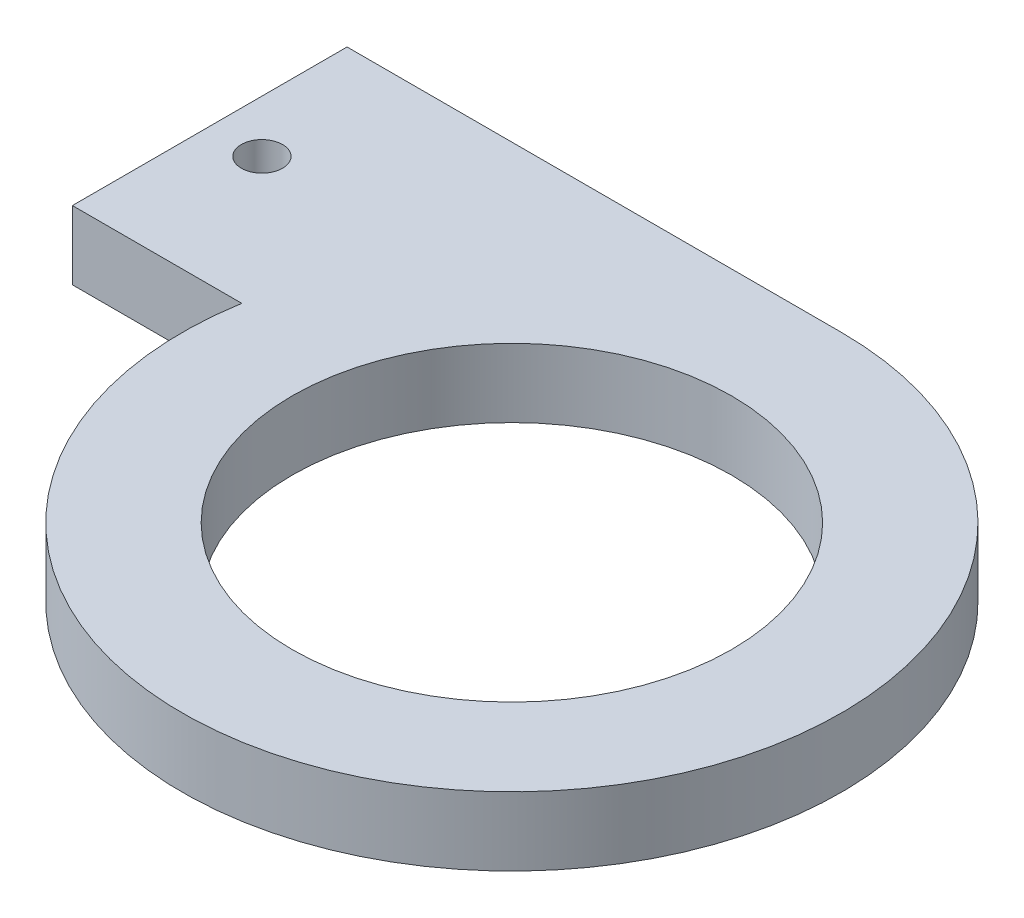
ISO-10303-21;
HEADER;
FILE_DESCRIPTION(('STEP AP214'),'2;1');
FILE_NAME('part.step','',(''),(''),'','','');
FILE_SCHEMA(('AUTOMOTIVE_DESIGN { 1 0 10303 214 1 1 1 1 }'));
ENDSEC;
DATA;
#1=APPLICATION_CONTEXT('core data for automotive mechanical design processes');
#2=APPLICATION_PROTOCOL_DEFINITION('international standard','automotive_design',2000,#1);
#3=PRODUCT_CONTEXT('',#1,'mechanical');
#4=PRODUCT('Part','Part','',(#3));
#5=PRODUCT_RELATED_PRODUCT_CATEGORY('part','',(#4));
#6=PRODUCT_DEFINITION_FORMATION('','',#4);
#7=PRODUCT_DEFINITION_CONTEXT('part definition',#1,'design');
#8=PRODUCT_DEFINITION('design','',#6,#7);
#9=PRODUCT_DEFINITION_SHAPE('','',#8);
#10=(LENGTH_UNIT() NAMED_UNIT(*) SI_UNIT(.MILLI.,.METRE.));
#11=(NAMED_UNIT(*) PLANE_ANGLE_UNIT() SI_UNIT($,.RADIAN.));
#12=(NAMED_UNIT(*) SI_UNIT($,.STERADIAN.) SOLID_ANGLE_UNIT());
#13=UNCERTAINTY_MEASURE_WITH_UNIT(LENGTH_MEASURE(1.E-05),#10,'distance_accuracy_value','');
#14=(GEOMETRIC_REPRESENTATION_CONTEXT(3) GLOBAL_UNCERTAINTY_ASSIGNED_CONTEXT((#13)) GLOBAL_UNIT_ASSIGNED_CONTEXT((#10,
#11,#12)) REPRESENTATION_CONTEXT('',''));
#15=CARTESIAN_POINT('',(0.,0.,0.));
#16=DIRECTION('',(0.,0.,1.));
#17=DIRECTION('',(1.,0.,0.));
#18=AXIS2_PLACEMENT_3D('',#15,#16,#17);
#19=CARTESIAN_POINT('',(0.,5.,-4.));
#20=DIRECTION('',(0.,0.,-1.));
#21=DIRECTION('',(-1.,0.,0.));
#22=AXIS2_PLACEMENT_3D('',#19,#20,#21);
#23=PLANE('',#22);
#24=DIRECTION('',(1.,0.,0.));
#25=VECTOR('',#24,1.);
#26=CARTESIAN_POINT('',(0.,0.,-4.));
#27=LINE('',#26,#25);
#28=CARTESIAN_POINT('',(-36.,0.,-4.));
#29=VERTEX_POINT('',#28);
#30=CARTESIAN_POINT('',(-23.6643191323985,0.,-4.));
#31=VERTEX_POINT('',#30);
#32=EDGE_CURVE('E106',#29,#31,#27,.T.);
#33=ORIENTED_EDGE('',*,*,#32,.T.);
#34=DIRECTION('',(0.,-1.,0.));
#35=VECTOR('',#34,1.);
#36=CARTESIAN_POINT('',(-23.6643191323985,5.,-4.));
#37=LINE('',#36,#35);
#38=CARTESIAN_POINT('',(-23.6643191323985,5.,-4.));
#39=VERTEX_POINT('',#38);
#40=EDGE_CURVE('E11',#39,#31,#37,.T.);
#41=ORIENTED_EDGE('',*,*,#40,.F.);
#42=DIRECTION('',(1.,0.,0.));
#43=VECTOR('',#42,1.);
#44=CARTESIAN_POINT('',(0.,5.,-4.));
#45=LINE('',#44,#43);
#46=CARTESIAN_POINT('',(-36.,5.,-4.));
#47=VERTEX_POINT('',#46);
#48=EDGE_CURVE('E88',#47,#39,#45,.T.);
#49=ORIENTED_EDGE('',*,*,#48,.F.);
#50=DIRECTION('',(0.,-1.,0.));
#51=VECTOR('',#50,1.);
#52=CARTESIAN_POINT('',(-36.,5.,-4.));
#53=LINE('',#52,#51);
#54=EDGE_CURVE('E102',#47,#29,#53,.T.);
#55=ORIENTED_EDGE('',*,*,#54,.T.);
#56=EDGE_LOOP('',(#33,#41,#49,#55));
#57=FACE_BOUND('',#56,.T.);
#58=ADVANCED_FACE('F35',(#57),#23,.F.);
#59=CARTESIAN_POINT('',(0.,5.,0.));
#60=DIRECTION('',(0.,-1.,0.));
#61=DIRECTION('',(0.,0.,-1.));
#62=AXIS2_PLACEMENT_3D('',#59,#60,#61);
#63=CYLINDRICAL_SURFACE('',#62,24.);
#64=CARTESIAN_POINT('',(0.,0.,0.));
#65=DIRECTION('',(0.,1.,0.));
#66=DIRECTION('',(0.,0.,1.));
#67=AXIS2_PLACEMENT_3D('',#64,#65,#66);
#68=CIRCLE('',#67,24.);
#69=CARTESIAN_POINT('',(0.,0.,-24.));
#70=VERTEX_POINT('',#69);
#71=EDGE_CURVE('E92',#31,#70,#68,.T.);
#72=ORIENTED_EDGE('',*,*,#71,.T.);
#73=DIRECTION('',(0.,-1.,0.));
#74=VECTOR('',#73,1.);
#75=CARTESIAN_POINT('',(0.,5.,-24.));
#76=LINE('',#75,#74);
#77=CARTESIAN_POINT('',(0.,5.,-24.));
#78=VERTEX_POINT('',#77);
#79=EDGE_CURVE('E44',#78,#70,#76,.T.);
#80=ORIENTED_EDGE('',*,*,#79,.F.);
#81=CARTESIAN_POINT('',(0.,5.,0.));
#82=DIRECTION('',(0.,1.,0.));
#83=DIRECTION('',(0.,0.,1.));
#84=AXIS2_PLACEMENT_3D('',#81,#82,#83);
#85=CIRCLE('',#84,24.);
#86=EDGE_CURVE('E82',#39,#78,#85,.T.);
#87=ORIENTED_EDGE('',*,*,#86,.F.);
#88=ORIENTED_EDGE('',*,*,#40,.T.);
#89=EDGE_LOOP('',(#72,#80,#87,#88));
#90=FACE_BOUND('',#89,.T.);
#91=ADVANCED_FACE('F91',(#90),#63,.T.);
#92=CARTESIAN_POINT('',(0.,5.,-24.));
#93=DIRECTION('',(0.,0.,1.));
#94=DIRECTION('',(1.,0.,0.));
#95=AXIS2_PLACEMENT_3D('',#92,#93,#94);
#96=PLANE('',#95);
#97=DIRECTION('',(-1.,0.,0.));
#98=VECTOR('',#97,1.);
#99=CARTESIAN_POINT('',(0.,0.,-24.));
#100=LINE('',#99,#98);
#101=CARTESIAN_POINT('',(-36.,0.,-24.));
#102=VERTEX_POINT('',#101);
#103=EDGE_CURVE('E69',#70,#102,#100,.T.);
#104=ORIENTED_EDGE('',*,*,#103,.T.);
#105=DIRECTION('',(0.,-1.,0.));
#106=VECTOR('',#105,1.);
#107=CARTESIAN_POINT('',(-36.,5.,-24.));
#108=LINE('',#107,#106);
#109=CARTESIAN_POINT('',(-36.,5.,-24.));
#110=VERTEX_POINT('',#109);
#111=EDGE_CURVE('E93',#110,#102,#108,.T.);
#112=ORIENTED_EDGE('',*,*,#111,.F.);
#113=DIRECTION('',(-1.,0.,0.));
#114=VECTOR('',#113,1.);
#115=CARTESIAN_POINT('',(0.,5.,-24.));
#116=LINE('',#115,#114);
#117=EDGE_CURVE('E86',#78,#110,#116,.T.);
#118=ORIENTED_EDGE('',*,*,#117,.F.);
#119=ORIENTED_EDGE('',*,*,#79,.T.);
#120=EDGE_LOOP('',(#104,#112,#118,#119));
#121=FACE_BOUND('',#120,.T.);
#122=ADVANCED_FACE('F94',(#121),#96,.F.);
#123=CARTESIAN_POINT('',(-36.,5.,0.));
#124=DIRECTION('',(1.,0.,0.));
#125=DIRECTION('',(0.,0.,-1.));
#126=AXIS2_PLACEMENT_3D('',#123,#124,#125);
#127=PLANE('',#126);
#128=DIRECTION('',(0.,0.,1.));
#129=VECTOR('',#128,1.);
#130=CARTESIAN_POINT('',(-36.,0.,0.));
#131=LINE('',#130,#129);
#132=EDGE_CURVE('E75',#102,#29,#131,.T.);
#133=ORIENTED_EDGE('',*,*,#132,.T.);
#134=ORIENTED_EDGE('',*,*,#54,.F.);
#135=DIRECTION('',(0.,0.,1.));
#136=VECTOR('',#135,1.);
#137=CARTESIAN_POINT('',(-36.,5.,0.));
#138=LINE('',#137,#136);
#139=EDGE_CURVE('E52',#110,#47,#138,.T.);
#140=ORIENTED_EDGE('',*,*,#139,.F.);
#141=ORIENTED_EDGE('',*,*,#111,.T.);
#142=EDGE_LOOP('',(#133,#134,#140,#141));
#143=FACE_BOUND('',#142,.T.);
#144=ADVANCED_FACE('F117',(#143),#127,.F.);
#145=CARTESIAN_POINT('',(-32.2,5.,-14.));
#146=DIRECTION('',(0.,-1.,0.));
#147=DIRECTION('',(0.,0.,-1.));
#148=AXIS2_PLACEMENT_3D('',#145,#146,#147);
#149=CYLINDRICAL_SURFACE('',#148,1.5);
#150=CARTESIAN_POINT('',(-32.2,5.,-14.));
#151=DIRECTION('',(0.,1.,0.));
#152=DIRECTION('',(0.,0.,1.));
#153=AXIS2_PLACEMENT_3D('',#150,#151,#152);
#154=CIRCLE('',#153,1.5);
#155=CARTESIAN_POINT('',(-32.2,5.,-12.5));
#156=VERTEX_POINT('',#155);
#157=EDGE_CURVE('E115',#156,#156,#154,.T.);
#158=ORIENTED_EDGE('',*,*,#157,.T.);
#159=EDGE_LOOP('',(#158));
#160=FACE_BOUND('',#159,.T.);
#161=CARTESIAN_POINT('',(-32.2,0.,-14.));
#162=DIRECTION('',(0.,1.,0.));
#163=DIRECTION('',(0.,0.,1.));
#164=AXIS2_PLACEMENT_3D('',#161,#162,#163);
#165=CIRCLE('',#164,1.5);
#166=CARTESIAN_POINT('',(-32.2,0.,-12.5));
#167=VERTEX_POINT('',#166);
#168=EDGE_CURVE('E103',#167,#167,#165,.T.);
#169=ORIENTED_EDGE('',*,*,#168,.F.);
#170=EDGE_LOOP('',(#169));
#171=FACE_BOUND('',#170,.T.);
#172=ADVANCED_FACE('F37',(#160,#171),#149,.F.);
#173=CARTESIAN_POINT('',(0.,5.,0.));
#174=DIRECTION('',(0.,-1.,0.));
#175=DIRECTION('',(0.,0.,-1.));
#176=AXIS2_PLACEMENT_3D('',#173,#174,#175);
#177=CYLINDRICAL_SURFACE('',#176,16.);
#178=CARTESIAN_POINT('',(0.,5.,0.));
#179=DIRECTION('',(0.,1.,0.));
#180=DIRECTION('',(0.,0.,1.));
#181=AXIS2_PLACEMENT_3D('',#178,#179,#180);
#182=CIRCLE('',#181,16.);
#183=CARTESIAN_POINT('',(0.,5.,16.));
#184=VERTEX_POINT('',#183);
#185=EDGE_CURVE('E96',#184,#184,#182,.T.);
#186=ORIENTED_EDGE('',*,*,#185,.T.);
#187=EDGE_LOOP('',(#186));
#188=FACE_BOUND('',#187,.T.);
#189=CARTESIAN_POINT('',(0.,0.,0.));
#190=DIRECTION('',(0.,1.,0.));
#191=DIRECTION('',(0.,0.,1.));
#192=AXIS2_PLACEMENT_3D('',#189,#190,#191);
#193=CIRCLE('',#192,16.);
#194=CARTESIAN_POINT('',(0.,0.,16.));
#195=VERTEX_POINT('',#194);
#196=EDGE_CURVE('E112',#195,#195,#193,.T.);
#197=ORIENTED_EDGE('',*,*,#196,.F.);
#198=EDGE_LOOP('',(#197));
#199=FACE_BOUND('',#198,.T.);
#200=ADVANCED_FACE('F130',(#188,#199),#177,.F.);
#201=CARTESIAN_POINT('',(0.,5.,0.));
#202=DIRECTION('',(0.,1.,0.));
#203=DIRECTION('',(0.,0.,1.));
#204=AXIS2_PLACEMENT_3D('',#201,#202,#203);
#205=PLANE('',#204);
#206=ORIENTED_EDGE('',*,*,#157,.F.);
#207=EDGE_LOOP('',(#206));
#208=FACE_BOUND('',#207,.T.);
#209=ORIENTED_EDGE('',*,*,#48,.T.);
#210=ORIENTED_EDGE('',*,*,#86,.T.);
#211=ORIENTED_EDGE('',*,*,#117,.T.);
#212=ORIENTED_EDGE('',*,*,#139,.T.);
#213=EDGE_LOOP('',(#209,#210,#211,#212));
#214=FACE_BOUND('',#213,.T.);
#215=ORIENTED_EDGE('',*,*,#185,.F.);
#216=EDGE_LOOP('',(#215));
#217=FACE_BOUND('',#216,.T.);
#218=ADVANCED_FACE('F83',(#208,#214,#217),#205,.T.);
#219=CARTESIAN_POINT('',(0.,0.,0.));
#220=DIRECTION('',(0.,1.,0.));
#221=DIRECTION('',(0.,0.,1.));
#222=AXIS2_PLACEMENT_3D('',#219,#220,#221);
#223=PLANE('',#222);
#224=ORIENTED_EDGE('',*,*,#168,.T.);
#225=EDGE_LOOP('',(#224));
#226=FACE_BOUND('',#225,.T.);
#227=ORIENTED_EDGE('',*,*,#32,.F.);
#228=ORIENTED_EDGE('',*,*,#132,.F.);
#229=ORIENTED_EDGE('',*,*,#103,.F.);
#230=ORIENTED_EDGE('',*,*,#71,.F.);
#231=EDGE_LOOP('',(#227,#228,#229,#230));
#232=FACE_BOUND('',#231,.T.);
#233=ORIENTED_EDGE('',*,*,#196,.T.);
#234=EDGE_LOOP('',(#233));
#235=FACE_BOUND('',#234,.T.);
#236=ADVANCED_FACE('F120',(#226,#232,#235),#223,.F.);
#237=CLOSED_SHELL('',(#58,#91,#122,#144,#172,#200,#218,#236));
#238=MANIFOLD_SOLID_BREP('B2',#237);
#239=ADVANCED_BREP_SHAPE_REPRESENTATION('',(#18,#238),#14);
#240=SHAPE_DEFINITION_REPRESENTATION(#9,#239);
ENDSEC;
END-ISO-10303-21;
